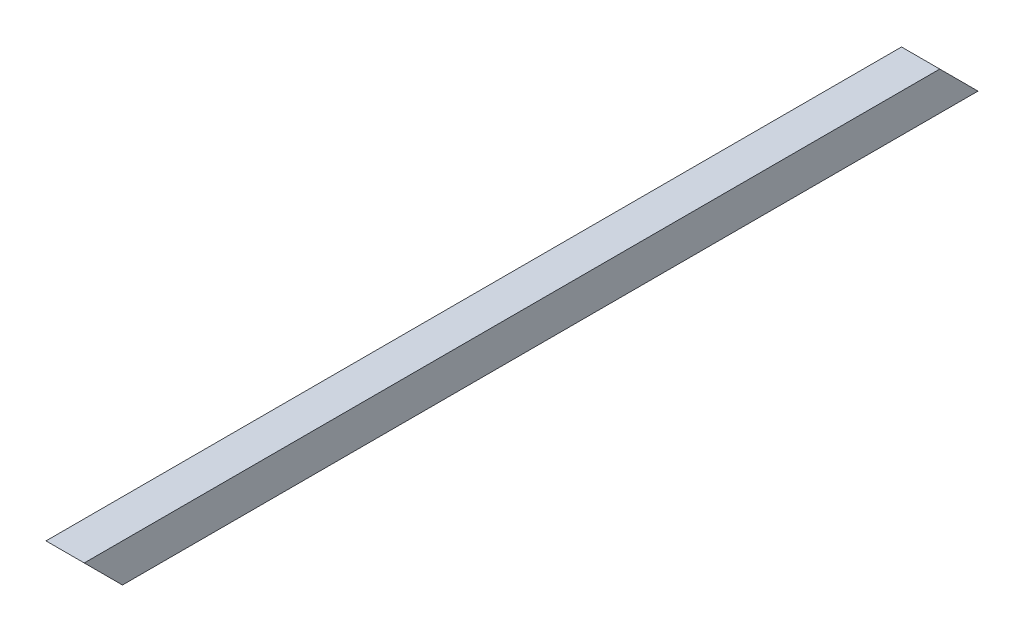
ISO-10303-21;
HEADER;
FILE_DESCRIPTION(('STEP AP214'),'2;1');
FILE_NAME('part.step','',(''),(''),'','','');
FILE_SCHEMA(('AUTOMOTIVE_DESIGN { 1 0 10303 214 1 1 1 1 }'));
ENDSEC;
DATA;
#1=APPLICATION_CONTEXT('core data for automotive mechanical design processes');
#2=APPLICATION_PROTOCOL_DEFINITION('international standard','automotive_design',2000,#1);
#3=PRODUCT_CONTEXT('',#1,'mechanical');
#4=PRODUCT('Part','Part','',(#3));
#5=PRODUCT_RELATED_PRODUCT_CATEGORY('part','',(#4));
#6=PRODUCT_DEFINITION_FORMATION('','',#4);
#7=PRODUCT_DEFINITION_CONTEXT('part definition',#1,'design');
#8=PRODUCT_DEFINITION('design','',#6,#7);
#9=PRODUCT_DEFINITION_SHAPE('','',#8);
#10=(LENGTH_UNIT() NAMED_UNIT(*) SI_UNIT(.MILLI.,.METRE.));
#11=(NAMED_UNIT(*) PLANE_ANGLE_UNIT() SI_UNIT($,.RADIAN.));
#12=(NAMED_UNIT(*) SI_UNIT($,.STERADIAN.) SOLID_ANGLE_UNIT());
#13=UNCERTAINTY_MEASURE_WITH_UNIT(LENGTH_MEASURE(1.E-05),#10,'distance_accuracy_value','');
#14=(GEOMETRIC_REPRESENTATION_CONTEXT(3) GLOBAL_UNCERTAINTY_ASSIGNED_CONTEXT((#13)) GLOBAL_UNIT_ASSIGNED_CONTEXT((#10,
#11,#12)) REPRESENTATION_CONTEXT('',''));
#15=CARTESIAN_POINT('',(0.,0.,0.));
#16=DIRECTION('',(0.,0.,1.));
#17=DIRECTION('',(1.,0.,0.));
#18=AXIS2_PLACEMENT_3D('',#15,#16,#17);
#19=CARTESIAN_POINT('',(80.,80.,1870.));
#20=DIRECTION('',(-1.,0.,0.));
#21=DIRECTION('',(0.,-1.,0.));
#22=AXIS2_PLACEMENT_3D('',#19,#20,#21);
#23=PLANE('',#22);
#24=DIRECTION('',(0.,0.,-1.));
#25=VECTOR('',#24,1.);
#26=CARTESIAN_POINT('',(80.,0.,1870.));
#27=LINE('',#26,#25);
#28=CARTESIAN_POINT('',(80.,0.,1790.));
#29=VERTEX_POINT('',#28);
#30=CARTESIAN_POINT('',(80.,0.,0.));
#31=VERTEX_POINT('',#30);
#32=EDGE_CURVE('E132',#29,#31,#27,.T.);
#33=ORIENTED_EDGE('',*,*,#32,.T.);
#34=DIRECTION('',(0.,0.707106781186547,0.707106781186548));
#35=VECTOR('',#34,1.);
#36=CARTESIAN_POINT('',(80.,80.,80.0000000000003));
#37=LINE('',#36,#35);
#38=CARTESIAN_POINT('',(80.,79.9999999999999,80.0000000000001));
#39=VERTEX_POINT('',#38);
#40=EDGE_CURVE('E11',#31,#39,#37,.T.);
#41=ORIENTED_EDGE('',*,*,#40,.T.);
#42=DIRECTION('',(0.,0.,-1.));
#43=VECTOR('',#42,1.);
#44=CARTESIAN_POINT('',(80.,80.,1870.));
#45=LINE('',#44,#43);
#46=CARTESIAN_POINT('',(80.,80.,1870.));
#47=VERTEX_POINT('',#46);
#48=EDGE_CURVE('E124',#47,#39,#45,.T.);
#49=ORIENTED_EDGE('',*,*,#48,.F.);
#50=DIRECTION('',(0.,0.707106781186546,0.707106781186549));
#51=VECTOR('',#50,1.);
#52=CARTESIAN_POINT('',(80.,80.,1870.));
#53=LINE('',#52,#51);
#54=EDGE_CURVE('E121',#47,#29,#53,.F.);
#55=ORIENTED_EDGE('',*,*,#54,.T.);
#56=EDGE_LOOP('',(#33,#41,#49,#55));
#57=FACE_BOUND('',#56,.T.);
#58=ADVANCED_FACE('F32',(#57),#23,.F.);
#59=CARTESIAN_POINT('',(80.,80.,1870.));
#60=DIRECTION('',(0.,-1.,0.));
#61=DIRECTION('',(0.,0.,-1.));
#62=AXIS2_PLACEMENT_3D('',#59,#60,#61);
#63=PLANE('',#62);
#64=ORIENTED_EDGE('',*,*,#48,.T.);
#65=DIRECTION('',(-1.,0.,0.));
#66=VECTOR('',#65,1.);
#67=CARTESIAN_POINT('',(0.,80.,80.0000000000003));
#68=LINE('',#67,#66);
#69=CARTESIAN_POINT('',(0.,79.9999999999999,80.0000000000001));
#70=VERTEX_POINT('',#69);
#71=EDGE_CURVE('E104',#39,#70,#68,.T.);
#72=ORIENTED_EDGE('',*,*,#71,.T.);
#73=DIRECTION('',(0.,0.,-1.));
#74=VECTOR('',#73,1.);
#75=CARTESIAN_POINT('',(0.,80.,1870.));
#76=LINE('',#75,#74);
#77=CARTESIAN_POINT('',(0.,80.,1870.));
#78=VERTEX_POINT('',#77);
#79=EDGE_CURVE('E126',#78,#70,#76,.T.);
#80=ORIENTED_EDGE('',*,*,#79,.F.);
#81=DIRECTION('',(-1.,0.,0.));
#82=VECTOR('',#81,1.);
#83=CARTESIAN_POINT('',(80.,80.,1870.));
#84=LINE('',#83,#82);
#85=EDGE_CURVE('E134',#47,#78,#84,.T.);
#86=ORIENTED_EDGE('',*,*,#85,.F.);
#87=EDGE_LOOP('',(#64,#72,#80,#86));
#88=FACE_BOUND('',#87,.T.);
#89=ADVANCED_FACE('F178',(#88),#63,.F.);
#90=CARTESIAN_POINT('',(0.,80.,1870.));
#91=DIRECTION('',(1.,0.,0.));
#92=DIRECTION('',(0.,1.,0.));
#93=AXIS2_PLACEMENT_3D('',#90,#91,#92);
#94=PLANE('',#93);
#95=ORIENTED_EDGE('',*,*,#79,.T.);
#96=DIRECTION('',(0.,-0.707106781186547,-0.707106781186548));
#97=VECTOR('',#96,1.);
#98=CARTESIAN_POINT('',(0.,80.,80.0000000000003));
#99=LINE('',#98,#97);
#100=CARTESIAN_POINT('',(0.,0.,0.));
#101=VERTEX_POINT('',#100);
#102=EDGE_CURVE('E42',#70,#101,#99,.T.);
#103=ORIENTED_EDGE('',*,*,#102,.T.);
#104=DIRECTION('',(0.,0.,-1.));
#105=VECTOR('',#104,1.);
#106=CARTESIAN_POINT('',(0.,0.,1870.));
#107=LINE('',#106,#105);
#108=CARTESIAN_POINT('',(0.,0.,1790.));
#109=VERTEX_POINT('',#108);
#110=EDGE_CURVE('E129',#109,#101,#107,.T.);
#111=ORIENTED_EDGE('',*,*,#110,.F.);
#112=DIRECTION('',(0.,-0.707106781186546,-0.707106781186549));
#113=VECTOR('',#112,1.);
#114=CARTESIAN_POINT('',(0.,80.,1870.));
#115=LINE('',#114,#113);
#116=EDGE_CURVE('E107',#109,#78,#115,.F.);
#117=ORIENTED_EDGE('',*,*,#116,.T.);
#118=EDGE_LOOP('',(#95,#103,#111,#117));
#119=FACE_BOUND('',#118,.T.);
#120=ADVANCED_FACE('F167',(#119),#94,.F.);
#121=CARTESIAN_POINT('',(80.,0.,1870.));
#122=DIRECTION('',(0.,1.,0.));
#123=DIRECTION('',(-1.,0.,0.));
#124=AXIS2_PLACEMENT_3D('',#121,#122,#123);
#125=PLANE('',#124);
#126=ORIENTED_EDGE('',*,*,#32,.F.);
#127=DIRECTION('',(-1.,0.,0.));
#128=VECTOR('',#127,1.);
#129=CARTESIAN_POINT('',(80.,0.,1790.));
#130=LINE('',#129,#128);
#131=EDGE_CURVE('E118',#29,#109,#130,.T.);
#132=ORIENTED_EDGE('',*,*,#131,.T.);
#133=ORIENTED_EDGE('',*,*,#110,.T.);
#134=DIRECTION('',(1.,0.,0.));
#135=VECTOR('',#134,1.);
#136=CARTESIAN_POINT('',(80.,0.,0.));
#137=LINE('',#136,#135);
#138=EDGE_CURVE('E88',#101,#31,#137,.T.);
#139=ORIENTED_EDGE('',*,*,#138,.T.);
#140=EDGE_LOOP('',(#126,#132,#133,#139));
#141=FACE_BOUND('',#140,.T.);
#142=ADVANCED_FACE('F175',(#141),#125,.F.);
#143=CARTESIAN_POINT('',(3.,77.,1870.));
#144=DIRECTION('',(1.,0.,0.));
#145=DIRECTION('',(0.,1.,0.));
#146=AXIS2_PLACEMENT_3D('',#143,#144,#145);
#147=PLANE('',#146);
#148=DIRECTION('',(0.,-0.707106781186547,-0.707106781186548));
#149=VECTOR('',#148,1.);
#150=CARTESIAN_POINT('',(2.99999999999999,80.,80.0000000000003));
#151=LINE('',#150,#149);
#152=CARTESIAN_POINT('',(3.,77.,77.0000000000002));
#153=VERTEX_POINT('',#152);
#154=CARTESIAN_POINT('',(3.,2.99999999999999,3.00000000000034));
#155=VERTEX_POINT('',#154);
#156=EDGE_CURVE('E36',#153,#155,#151,.T.);
#157=ORIENTED_EDGE('',*,*,#156,.F.);
#158=DIRECTION('',(0.,0.,-1.));
#159=VECTOR('',#158,1.);
#160=CARTESIAN_POINT('',(3.,77.,1870.));
#161=LINE('',#160,#159);
#162=CARTESIAN_POINT('',(3.,77.,1867.));
#163=VERTEX_POINT('',#162);
#164=EDGE_CURVE('E111',#163,#153,#161,.T.);
#165=ORIENTED_EDGE('',*,*,#164,.F.);
#166=DIRECTION('',(0.,0.707106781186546,0.707106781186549));
#167=VECTOR('',#166,1.);
#168=CARTESIAN_POINT('',(3.,78.5,1868.5));
#169=LINE('',#168,#167);
#170=CARTESIAN_POINT('',(3.,2.99999999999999,1793.));
#171=VERTEX_POINT('',#170);
#172=EDGE_CURVE('E87',#163,#171,#169,.F.);
#173=ORIENTED_EDGE('',*,*,#172,.T.);
#174=DIRECTION('',(0.,0.,-1.));
#175=VECTOR('',#174,1.);
#176=CARTESIAN_POINT('',(3.,2.99999999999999,1870.));
#177=LINE('',#176,#175);
#178=EDGE_CURVE('E71',#171,#155,#177,.T.);
#179=ORIENTED_EDGE('',*,*,#178,.T.);
#180=EDGE_LOOP('',(#157,#165,#173,#179));
#181=FACE_BOUND('',#180,.T.);
#182=ADVANCED_FACE('F83',(#181),#147,.T.);
#183=CARTESIAN_POINT('',(3.,2.99999999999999,1870.));
#184=DIRECTION('',(0.,1.,0.));
#185=DIRECTION('',(-1.,0.,0.));
#186=AXIS2_PLACEMENT_3D('',#183,#184,#185);
#187=PLANE('',#186);
#188=DIRECTION('',(1.,0.,0.));
#189=VECTOR('',#188,1.);
#190=CARTESIAN_POINT('',(80.,2.99999999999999,3.00000000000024));
#191=LINE('',#190,#189);
#192=CARTESIAN_POINT('',(77.,3.,3.00000000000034));
#193=VERTEX_POINT('',#192);
#194=EDGE_CURVE('E67',#155,#193,#191,.T.);
#195=ORIENTED_EDGE('',*,*,#194,.F.);
#196=ORIENTED_EDGE('',*,*,#178,.F.);
#197=DIRECTION('',(-1.,0.,0.));
#198=VECTOR('',#197,1.);
#199=CARTESIAN_POINT('',(3.,2.99999999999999,1793.));
#200=LINE('',#199,#198);
#201=CARTESIAN_POINT('',(77.,3.,1793.));
#202=VERTEX_POINT('',#201);
#203=EDGE_CURVE('E98',#171,#202,#200,.F.);
#204=ORIENTED_EDGE('',*,*,#203,.T.);
#205=DIRECTION('',(0.,0.,-1.));
#206=VECTOR('',#205,1.);
#207=CARTESIAN_POINT('',(77.,3.,1870.));
#208=LINE('',#207,#206);
#209=EDGE_CURVE('E74',#202,#193,#208,.T.);
#210=ORIENTED_EDGE('',*,*,#209,.T.);
#211=EDGE_LOOP('',(#195,#196,#204,#210));
#212=FACE_BOUND('',#211,.T.);
#213=ADVANCED_FACE('F69',(#212),#187,.T.);
#214=CARTESIAN_POINT('',(77.,77.,1870.));
#215=DIRECTION('',(-1.,0.,0.));
#216=DIRECTION('',(0.,0.,1.));
#217=AXIS2_PLACEMENT_3D('',#214,#215,#216);
#218=PLANE('',#217);
#219=DIRECTION('',(0.,0.707106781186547,0.707106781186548));
#220=VECTOR('',#219,1.);
#221=CARTESIAN_POINT('',(77.,80.,80.0000000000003));
#222=LINE('',#221,#220);
#223=CARTESIAN_POINT('',(77.,77.,77.0000000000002));
#224=VERTEX_POINT('',#223);
#225=EDGE_CURVE('E79',#193,#224,#222,.T.);
#226=ORIENTED_EDGE('',*,*,#225,.F.);
#227=ORIENTED_EDGE('',*,*,#209,.F.);
#228=DIRECTION('',(0.,-0.707106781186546,-0.707106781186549));
#229=VECTOR('',#228,1.);
#230=CARTESIAN_POINT('',(77.,78.5,1868.5));
#231=LINE('',#230,#229);
#232=CARTESIAN_POINT('',(77.,77.,1867.));
#233=VERTEX_POINT('',#232);
#234=EDGE_CURVE('E112',#202,#233,#231,.F.);
#235=ORIENTED_EDGE('',*,*,#234,.T.);
#236=DIRECTION('',(0.,0.,-1.));
#237=VECTOR('',#236,1.);
#238=CARTESIAN_POINT('',(77.,77.,1870.));
#239=LINE('',#238,#237);
#240=EDGE_CURVE('E140',#233,#224,#239,.T.);
#241=ORIENTED_EDGE('',*,*,#240,.T.);
#242=EDGE_LOOP('',(#226,#227,#235,#241));
#243=FACE_BOUND('',#242,.T.);
#244=ADVANCED_FACE('F153',(#243),#218,.T.);
#245=CARTESIAN_POINT('',(3.,77.,1870.));
#246=DIRECTION('',(0.,-1.,0.));
#247=DIRECTION('',(0.,0.,-1.));
#248=AXIS2_PLACEMENT_3D('',#245,#246,#247);
#249=PLANE('',#248);
#250=DIRECTION('',(-1.,0.,0.));
#251=VECTOR('',#250,1.);
#252=CARTESIAN_POINT('',(80.,77.,77.0000000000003));
#253=LINE('',#252,#251);
#254=EDGE_CURVE('E92',#224,#153,#253,.T.);
#255=ORIENTED_EDGE('',*,*,#254,.F.);
#256=ORIENTED_EDGE('',*,*,#240,.F.);
#257=DIRECTION('',(1.,0.,0.));
#258=VECTOR('',#257,1.);
#259=CARTESIAN_POINT('',(3.,77.,1867.));
#260=LINE('',#259,#258);
#261=EDGE_CURVE('E108',#233,#163,#260,.F.);
#262=ORIENTED_EDGE('',*,*,#261,.T.);
#263=ORIENTED_EDGE('',*,*,#164,.T.);
#264=EDGE_LOOP('',(#255,#256,#262,#263));
#265=FACE_BOUND('',#264,.T.);
#266=ADVANCED_FACE('F142',(#265),#249,.T.);
#267=CARTESIAN_POINT('',(80.,80.,1870.));
#268=DIRECTION('',(0.,0.707106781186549,-0.707106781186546));
#269=DIRECTION('',(0.,0.707106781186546,0.707106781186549));
#270=AXIS2_PLACEMENT_3D('',#267,#268,#269);
#271=PLANE('',#270);
#272=ORIENTED_EDGE('',*,*,#116,.F.);
#273=ORIENTED_EDGE('',*,*,#131,.F.);
#274=ORIENTED_EDGE('',*,*,#54,.F.);
#275=ORIENTED_EDGE('',*,*,#85,.T.);
#276=EDGE_LOOP('',(#272,#273,#274,#275));
#277=FACE_BOUND('',#276,.T.);
#278=ORIENTED_EDGE('',*,*,#172,.F.);
#279=ORIENTED_EDGE('',*,*,#261,.F.);
#280=ORIENTED_EDGE('',*,*,#234,.F.);
#281=ORIENTED_EDGE('',*,*,#203,.F.);
#282=EDGE_LOOP('',(#278,#279,#280,#281));
#283=FACE_BOUND('',#282,.T.);
#284=ADVANCED_FACE('F148',(#277,#283),#271,.F.);
#285=CARTESIAN_POINT('',(80.,80.,80.0000000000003));
#286=DIRECTION('',(0.,0.707106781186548,-0.707106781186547));
#287=DIRECTION('',(0.,0.707106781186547,0.707106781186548));
#288=AXIS2_PLACEMENT_3D('',#285,#286,#287);
#289=PLANE('',#288);
#290=ORIENTED_EDGE('',*,*,#40,.F.);
#291=ORIENTED_EDGE('',*,*,#138,.F.);
#292=ORIENTED_EDGE('',*,*,#102,.F.);
#293=ORIENTED_EDGE('',*,*,#71,.F.);
#294=EDGE_LOOP('',(#290,#291,#292,#293));
#295=FACE_BOUND('',#294,.T.);
#296=ORIENTED_EDGE('',*,*,#254,.T.);
#297=ORIENTED_EDGE('',*,*,#156,.T.);
#298=ORIENTED_EDGE('',*,*,#194,.T.);
#299=ORIENTED_EDGE('',*,*,#225,.T.);
#300=EDGE_LOOP('',(#296,#297,#298,#299));
#301=FACE_BOUND('',#300,.T.);
#302=ADVANCED_FACE('F34',(#295,#301),#289,.T.);
#303=CLOSED_SHELL('',(#58,#89,#120,#142,#182,#213,#244,#266,#284,#302));
#304=MANIFOLD_SOLID_BREP('B2',#303);
#305=ADVANCED_BREP_SHAPE_REPRESENTATION('',(#18,#304),#14);
#306=SHAPE_DEFINITION_REPRESENTATION(#9,#305);
ENDSEC;
END-ISO-10303-21;
